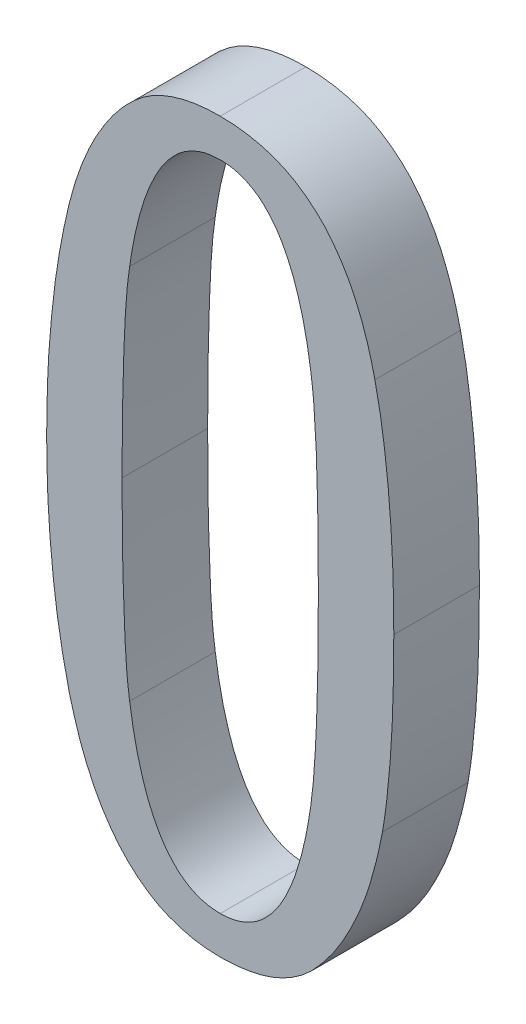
from build123d import *

# Parameters (mm, degrees)
EXTRUDE_1_DEPTH = 3


with BuildPart() as part:
    # Sketch 1 → Extrude 1 (new body)
    with BuildSketch(Plane.XY):
        with BuildLine():
            add(Edge.make_bspline(
                [(8.333333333, 23.941798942), (8.506663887, 23.938747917), (8.8447725, 23.932796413), (9.339588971, 23.865408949), (9.810267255, 23.763858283), (10.259523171, 23.62265805), (10.684182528, 23.433918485), (11.085514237, 23.205052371), (11.460488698, 22.93086982), (11.815806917, 22.622160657), (12.143794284, 22.268775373), (12.442824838, 21.872126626), (12.723156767, 21.438528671), (12.984640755, 20.963974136), (13.210434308, 20.441350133), (13.423958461, 19.884066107), (13.603610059, 19.281950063), (13.704637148, 18.86520265), (13.756613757, 18.650793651)],
                knots=[0, 0, 0, 0, 1.002232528, 1.955012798, 2.88349749, 3.785896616, 4.674237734, 5.567239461, 6.453618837, 7.357550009, 8.286803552, 9.237332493, 10.227963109, 11.272331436, 12.367886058, 13.519067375, 14.723605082, 16, 16, 16, 16], degree=3))
            add(Edge.make_bspline(
                [(13.756613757, 18.650793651), (13.811176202, 18.396478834), (13.923361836, 17.873583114), (14.051018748, 17.060278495), (14.164210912, 16.202726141), (14.256837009, 15.29925007), (14.329247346, 14.35012033), (14.384146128, 13.355448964), (14.412311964, 12.314819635), (14.416068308, 11.605932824), (14.417989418, 11.243386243)],
                knots=[0, 0, 0, 0, 0.837661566, 1.722312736, 2.650746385, 3.623751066, 4.647256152, 5.716622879, 6.832210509, 8, 8, 8, 8], degree=3))
            add(Edge.make_bspline(
                [(14.417989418, 11.243386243), (14.417592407, 10.924931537), (14.416818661, 10.304286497), (14.395153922, 9.399558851), (14.367979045, 8.54688392), (14.324428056, 7.74808456), (14.264868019, 7.001788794), (14.196476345, 6.307640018), (14.12166737, 5.664853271), (14.053728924, 5.256489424), (14.021164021, 5.060748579)],
                knots=[0, 0, 0, 0, 1.232217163, 2.401501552, 3.501657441, 4.533219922, 5.496693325, 6.398338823, 7.232276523, 8, 8, 8, 8], degree=3))
            add(Edge.make_bspline(
                [(14.021164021, 5.060748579), (13.962580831, 4.767629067), (13.848626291, 4.197460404), (13.624003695, 3.37579722), (13.375677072, 2.60469802), (13.072075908, 1.892008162), (12.740948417, 1.229245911), (12.374467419, 0.618887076), (11.966296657, 0.063723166), (11.659720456, -0.267254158), (11.507936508, -0.43111895)],
                knots=[0, 0, 0, 0, 1.170368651, 2.276571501, 3.334362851, 4.340483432, 5.307271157, 6.234138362, 7.125733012, 8, 8, 8, 8], degree=3))
            add(Edge.make_bspline(
                [(11.507936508, -0.43111895), (11.407132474, -0.523511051), (11.205014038, -0.708763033), (10.864424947, -0.939937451), (10.506070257, -1.14502029), (10.118691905, -1.306150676), (9.707382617, -1.434582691), (9.270194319, -1.519833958), (8.809997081, -1.576050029), (8.495179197, -1.583481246), (8.333333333, -1.587301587)],
                knots=[0, 0, 0, 0, 0.945553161, 1.895893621, 2.842527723, 3.800104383, 4.794293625, 5.8209343, 6.879756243, 8, 8, 8, 8], degree=3))
            add(Edge.make_bspline(
                [(8.333333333, -1.587301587), (8.173094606, -1.583917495), (7.856205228, -1.577225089), (7.391455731, -1.512758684), (6.947239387, -1.403916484), (6.52435765, -1.255745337), (6.118144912, -1.072297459), (5.740757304, -0.830361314), (5.376899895, -0.558877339), (5.036856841, -0.239244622), (4.71167865, 0.116592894), (4.415883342, 0.5235045), (4.128028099, 0.963190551), (3.871567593, 1.450958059), (3.630345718, 1.977236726), (3.409411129, 2.545992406), (3.216149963, 3.159568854), (3.10123686, 3.584069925), (3.042328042, 3.801685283)],
                knots=[0, 0, 0, 0, 0.935722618, 1.850492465, 2.734395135, 3.603343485, 4.465562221, 5.331204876, 6.216547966, 7.11439616, 8.053274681, 9.02829533, 10.049770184, 11.121085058, 12.243838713, 13.430861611, 14.682962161, 16, 16, 16, 16], degree=3))
            add(Edge.make_bspline(
                [(3.042328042, 3.801685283), (2.97818925, 4.078860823), (2.848117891, 4.640963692), (2.689648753, 5.502718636), (2.549637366, 6.390922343), (2.445775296, 7.308373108), (2.356282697, 8.252231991), (2.291533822, 9.224182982), (2.259574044, 10.224162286), (2.252343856, 10.900432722), (2.248677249, 11.243386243)],
                knots=[0, 0, 0, 0, 0.910164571, 1.845783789, 2.802751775, 3.786558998, 4.799353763, 5.836124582, 6.902645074, 8, 8, 8, 8], degree=3))
            add(Edge.make_bspline(
                [(2.248677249, 11.243386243), (2.252340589, 11.586340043), (2.259564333, 12.262611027), (2.291570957, 13.262586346), (2.356041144, 14.232929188), (2.445770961, 15.173508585), (2.549696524, 16.086053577), (2.689132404, 16.967830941), (2.848144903, 17.821349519), (2.978203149, 18.376887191), (3.042328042, 18.650793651)],
                knots=[0, 0, 0, 0, 1.102317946, 2.173662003, 3.215121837, 4.227271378, 5.210315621, 6.166425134, 7.095960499, 8, 8, 8, 8], degree=3))
            add(Edge.make_bspline(
                [(3.042328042, 18.650793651), (3.101461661, 18.877011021), (3.216903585, 19.318637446), (3.434790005, 19.95072805), (3.675353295, 20.54349922), (3.941439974, 21.094839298), (4.239859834, 21.603459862), (4.555617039, 22.075247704), (4.902895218, 22.505652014), (5.162685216, 22.758638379), (5.291005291, 22.883597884)],
                knots=[0, 0, 0, 0, 1.154602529, 2.254039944, 3.29960314, 4.313348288, 5.274881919, 6.210069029, 7.115885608, 8, 8, 8, 8], degree=3))
            add(Edge.make_bspline(
                [(5.291005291, 22.883597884), (5.387126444, 22.969221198), (5.579058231, 23.140191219), (5.901095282, 23.355187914), (6.24559645, 23.538136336), (6.616260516, 23.683743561), (7.010472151, 23.803634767), (7.430838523, 23.884261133), (7.874823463, 23.935103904), (8.17804962, 23.939531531), (8.333333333, 23.941798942)],
                knots=[0, 0, 0, 0, 0.934702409, 1.866385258, 2.806198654, 3.765009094, 4.75640183, 5.796955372, 6.871809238, 8, 8, 8, 8], degree=3))
        make_face()
        with BuildLine():
            add(Edge.make_bspline(
                [(8.333333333, -0.264550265), (8.434918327, -0.26105088), (8.634947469, -0.254160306), (8.925846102, -0.191610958), (9.204002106, -0.100088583), (9.466390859, 0.036247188), (9.717534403, 0.20610336), (9.947278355, 0.422677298), (10.170346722, 0.667523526), (10.375429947, 0.95448706), (10.566993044, 1.279184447), (10.740007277, 1.643471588), (10.910315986, 2.039994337), (11.053055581, 2.479493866), (11.192034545, 2.954141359), (11.312249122, 3.468014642), (11.421337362, 4.018521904), (11.478475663, 4.399105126), (11.507936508, 4.595336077)],
                knots=[0, 0, 0, 0, 0.770209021, 1.516604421, 2.249703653, 2.987087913, 3.753897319, 4.543613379, 5.377533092, 6.265279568, 7.215649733, 8.235821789, 9.324850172, 10.489174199, 11.74077537, 13.078842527, 14.493834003, 16, 16, 16, 16], degree=3))
            add(Edge.make_bspline(
                [(11.507936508, 4.595336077), (11.530393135, 4.765031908), (11.579309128, 5.134670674), (11.630216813, 5.736266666), (11.672143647, 6.428968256), (11.714678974, 7.212671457), (11.732334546, 8.090045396), (11.762923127, 9.059846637), (11.767790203, 10.121502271), (11.770880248, 10.859630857), (11.772486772, 11.243386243)],
                knots=[0, 0, 0, 0, 0.617010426, 1.343998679, 2.175751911, 3.118845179, 4.173025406, 5.339018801, 6.616547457, 8, 8, 8, 8], degree=3))
            add(Edge.make_bspline(
                [(11.772486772, 11.243386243), (11.770890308, 11.625508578), (11.767833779, 12.35710529), (11.762861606, 13.408963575), (11.732445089, 14.365701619), (11.714610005, 15.231646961), (11.672078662, 16.003911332), (11.630790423, 16.683609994), (11.579126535, 17.270469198), (11.530368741, 17.628660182), (11.507936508, 17.79345483)],
                knots=[0, 0, 0, 0, 1.398091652, 2.676732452, 3.848153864, 4.900124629, 5.845335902, 6.677557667, 7.391577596, 8, 8, 8, 8], degree=3))
            add(Edge.make_bspline(
                [(11.507936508, 17.79345483), (11.478354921, 17.988030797), (11.420754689, 18.366902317), (11.312954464, 18.914409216), (11.191924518, 19.424847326), (11.053356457, 19.894751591), (10.909058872, 20.330357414), (10.741554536, 20.72485338), (10.565321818, 21.08586425), (10.377198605, 21.409419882), (10.168729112, 21.692373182), (9.947232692, 21.936527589), (9.718993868, 22.153780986), (9.464991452, 22.31810592), (9.203073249, 22.453066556), (8.927497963, 22.553983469), (8.634181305, 22.606622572), (8.434765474, 22.614858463), (8.333333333, 22.619047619)],
                knots=[0, 0, 0, 0, 1.500895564, 2.922491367, 4.254690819, 5.500172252, 6.65813513, 7.752246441, 8.765994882, 9.720800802, 10.602633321, 11.440445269, 12.233847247, 12.997257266, 13.738083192, 14.478699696, 15.226196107, 16, 16, 16, 16], degree=3))
            add(Edge.make_bspline(
                [(8.333333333, 22.619047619), (8.231901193, 22.614858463), (8.032485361, 22.606622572), (7.739168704, 22.553983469), (7.463593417, 22.453066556), (7.201675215, 22.31810592), (6.947672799, 22.153780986), (6.719433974, 21.936527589), (6.497937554, 21.692373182), (6.289468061, 21.409419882), (6.101344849, 21.08586425), (5.92511213, 20.72485338), (5.757607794, 20.330357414), (5.61331021, 19.894751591), (5.474742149, 19.424847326), (5.353712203, 18.914409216), (5.245911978, 18.366902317), (5.188311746, 17.988030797), (5.158730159, 17.79345483)],
                knots=[0, 0, 0, 0, 0.773803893, 1.521300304, 2.261916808, 3.002742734, 3.766152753, 4.559554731, 5.397366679, 6.279199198, 7.234005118, 8.247753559, 9.34186487, 10.499827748, 11.745309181, 13.077508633, 14.499104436, 16, 16, 16, 16], degree=3))
            add(Edge.make_bspline(
                [(5.158730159, 17.79345483), (5.13616645, 17.636844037), (5.08623177, 17.290256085), (5.036480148, 16.71786563), (4.992446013, 16.046556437), (4.960396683, 15.277100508), (4.93158166, 14.409937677), (4.904469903, 13.443229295), (4.898639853, 12.37670908), (4.895709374, 11.632043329), (4.894179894, 11.243386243)],
                knots=[0, 0, 0, 0, 0.5787888, 1.280890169, 2.101163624, 3.040095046, 4.098192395, 5.275551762, 6.578051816, 8, 8, 8, 8], degree=3))
            add(Edge.make_bspline(
                [(4.894179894, 11.243386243), (4.895699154, 10.851462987), (4.898604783, 10.101897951), (4.904569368, 9.025582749), (4.931645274, 8.047445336), (4.960243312, 7.167206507), (4.992758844, 6.384722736), (5.036135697, 5.701928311), (5.08711352, 5.115005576), (5.136245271, 4.758492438), (5.158730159, 4.595336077)],
                knots=[0, 0, 0, 0, 1.412851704, 2.702121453, 3.879855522, 4.940073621, 5.876986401, 6.702843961, 7.406363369, 8, 8, 8, 8], degree=3))
            add(Edge.make_bspline(
                [(5.158730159, 4.595336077), (5.188191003, 4.399105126), (5.245329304, 4.018521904), (5.354417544, 3.468014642), (5.474632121, 2.954141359), (5.613611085, 2.479493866), (5.75635068, 2.039994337), (5.926659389, 1.643471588), (6.099673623, 1.279184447), (6.29123672, 0.95448706), (6.496319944, 0.667523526), (6.719388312, 0.422677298), (6.949132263, 0.20610336), (7.200275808, 0.036247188), (7.462664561, -0.100088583), (7.740820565, -0.191610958), (8.031719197, -0.254160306), (8.23174834, -0.26105088), (8.333333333, -0.264550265)],
                knots=[0, 0, 0, 0, 1.506165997, 2.921157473, 4.25922463, 5.510825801, 6.675149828, 7.764178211, 8.784350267, 9.734720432, 10.622466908, 11.456386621, 12.246102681, 13.012912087, 13.750296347, 14.483395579, 15.229790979, 16, 16, 16, 16], degree=3))
        make_face(mode=Mode.SUBTRACT)
    extrude(amount=EXTRUDE_1_DEPTH)


solid = part.part
